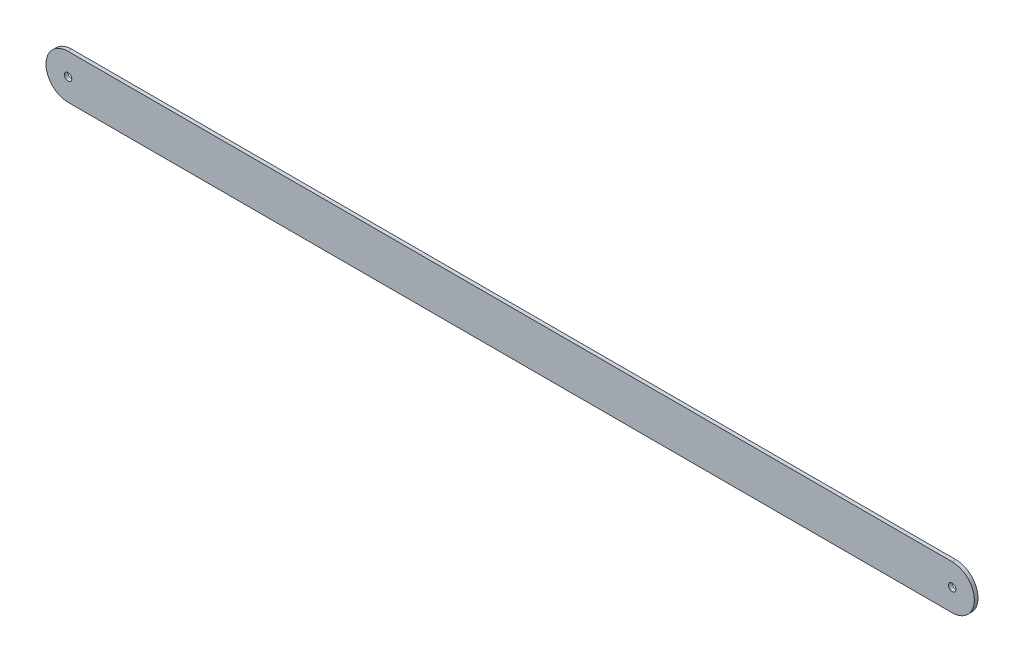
from build123d import *

# Parameters (mm, degrees)
SKETCH1_R           = 1
BOSS_EXTRUDE1_DEPTH = 1


with BuildPart() as part:
    # Sketch1 → Boss-Extrude1 (new body)
    with BuildSketch(Plane.XY):
        with BuildLine():
            Line((0, 6), (240, 6))
            ThreePointArc((240, 6), (246, 0), (240, -6))
            Line((240, -6), (0, -6))
            ThreePointArc((0, -6), (-6, 0), (0, 6))
        make_face()
        Circle(SKETCH1_R, mode=Mode.SUBTRACT)
        with Locations((240, 0)):
            Circle(SKETCH1_R, mode=Mode.SUBTRACT)
    extrude(amount=BOSS_EXTRUDE1_DEPTH)


solid = part.part
